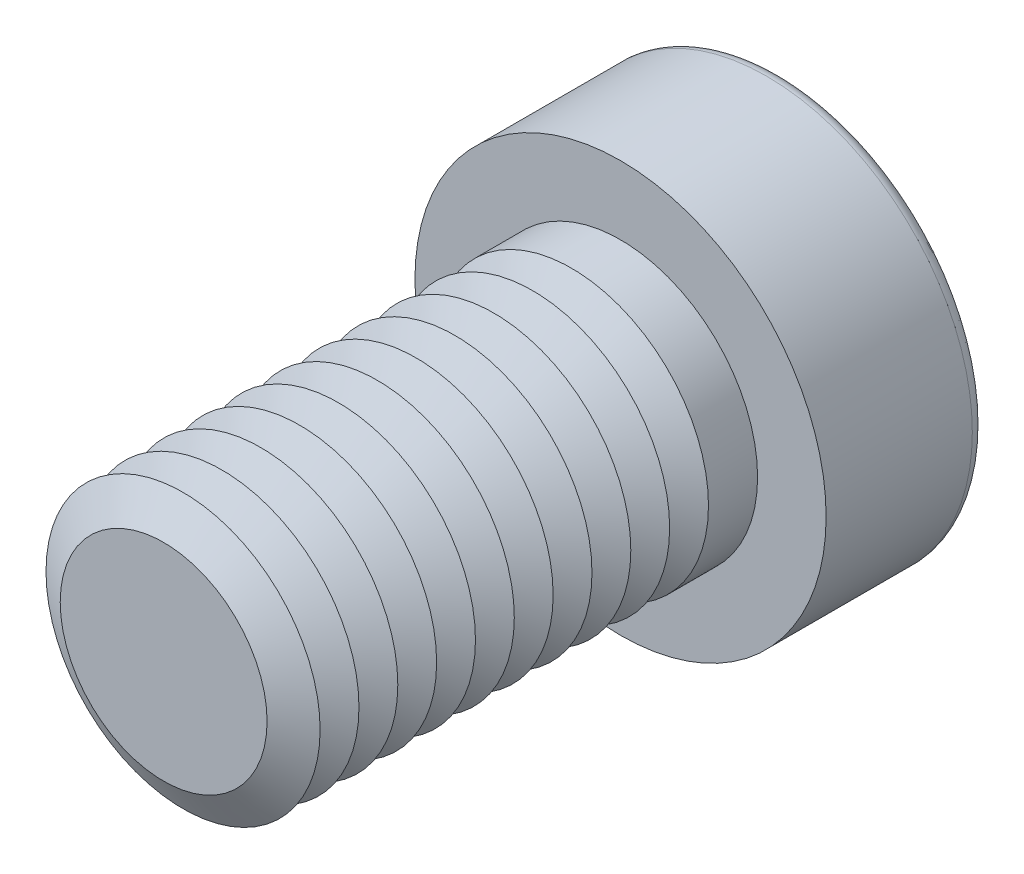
from build123d import *

# Parameters (mm, degrees)
SKETCH1_R           = 6
BOSS_EXTRUDE1_DEPTH = 20
SKETCH2_R           = 9
BOSS_EXTRUDE2_DEPTH = 7
CUT_EXTRUDE1_DEPTH  = 6
FILLET1_R           = 0.6
LPATTERN1_COUNT     = 11
LPATTERN1_PITCH     = 1.7


with BuildPart() as part:
    # Sketch1 → Boss-Extrude1 (new body)
    with BuildSketch(Plane.XY):
        Circle(SKETCH1_R)
    extrude(amount=BOSS_EXTRUDE1_DEPTH)

    # Sketch2 → Boss-Extrude2 (add)
    with BuildSketch(Plane(origin=(0, 0, 0), x_dir=(-1, 0, 0), z_dir=(0, 0, -1))):
        Circle(SKETCH2_R)
    extrude(amount=BOSS_EXTRUDE2_DEPTH)

    # Sketch3 → Cut-Extrude1 (cut)
    with BuildSketch(Plane(origin=(0, 0, -7), x_dir=(-1, 0, 0), z_dir=(0, 0, -1))):
        Polygon((-2.309401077, 4), (-4.618802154, 0), (-2.309401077, -4), (2.309401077, -4), (4.618802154, 0), (2.309401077, 4), align=None)
    extrude(amount=-CUT_EXTRUDE1_DEPTH, mode=Mode.SUBTRACT)

    # Fillet1
    fillet1_edges = [part.edges().sort_by_distance(p)[0] for p in [
        (9, 0, -7),
    ]]
    fillet(fillet1_edges, radius=FILLET1_R)

    # Cut-Extrude2 cone 1 section (on through the dimple's axis) → Cut-Extrude2 (revolve, cut)
    with BuildSketch(Plane(origin=(0, 0, -1), x_dir=(0, 1, 0), z_dir=(1, 0, 0))):
        Polygon((0, 0), (4, 0), (0, 2.309401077), align=None)
    revolve(axis=Axis((0, 0, -1), (0, 0, 1)), mode=Mode.SUBTRACT)

    # Cut-Extrude3 cone 1 section (on through the dimple's axis) → Cut-Extrude3 (revolve, cut)
    with BuildSketch(Plane(origin=(0, 0, -7), x_dir=(0, 1, 0), z_dir=(1, 0, 0))):
        Polygon((0, 0), (4.618802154, 0), (0, 1.237604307), align=None)
    revolve(axis=Axis((0, 0, -7), (0, 0, 1)), mode=Mode.SUBTRACT)

    # Sketch7 → Cut-Revolve1 (revolve, cut)
    with BuildSketch(Plane(origin=(0, 0, 0), x_dir=(0, 0, -1), z_dir=(1, 0, 0)), mode=Mode.PRIVATE) as cut_revolve1_sk:
        Polygon((-20, 4.527756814), (-19.15, 6), (-20.85, 6), align=None)
    cut_revolve1 = revolve(cut_revolve1_sk.sketch.rotate(Axis((0, 0, 20), (0, 0, -1)), 90), axis=Axis((0, 0, 20), (0, 0, -1)), mode=Mode.SUBTRACT)

    # LPattern1: Cut-Revolve1 ×11
    with Locations(*[(0, 0, -i * LPATTERN1_PITCH) for i in range(1, LPATTERN1_COUNT)]):
        add(cut_revolve1, mode=Mode.SUBTRACT)


solid = part.part
